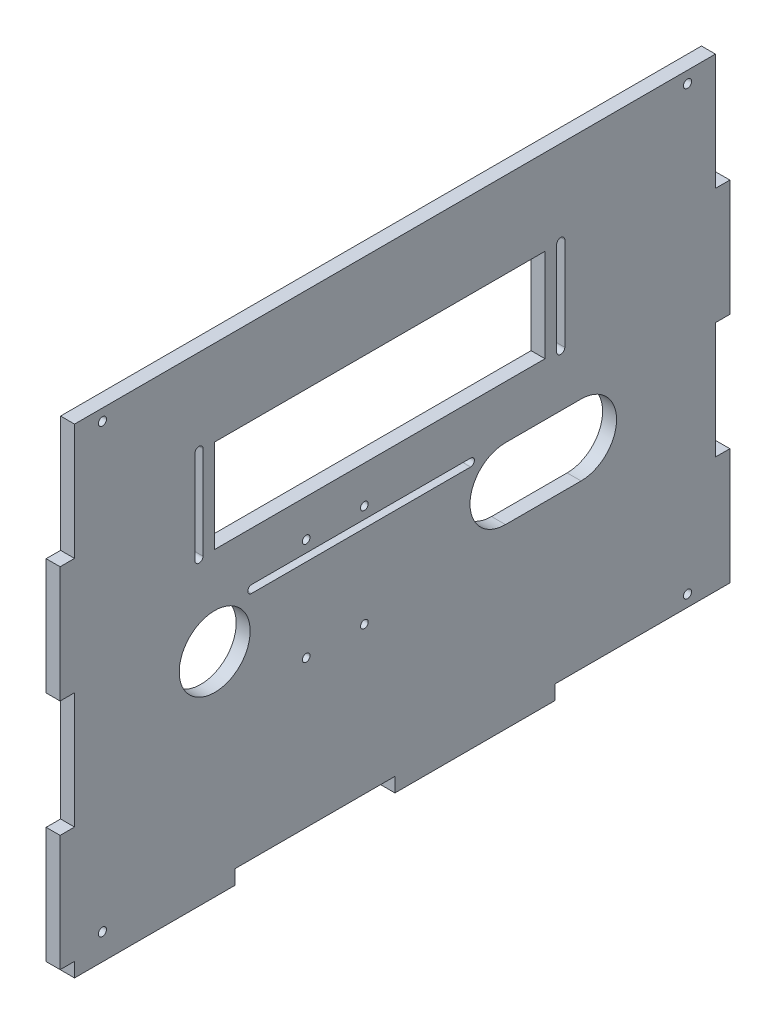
from build123d import *

# Parameters (mm, degrees)
CROQUIS1_W                 = 275.5
CROQUIS1_H                 = 200
CROQUIS1_R                 = 15.25
CROQUIS1_R_2               = 1.75
CROQUIS1_W_2               = 142
CROQUIS1_H_2               = 40
SALIENTE_EXTRUIR1_DEPTH    = 6
CROQUIS2_W                 = 6
CROQUIS2_H                 = 22
SALIENTE_EXTRUIR2_DEPTH    = 18
SALIENTE_EXTRUIR3_DEPTH    = 2
SALIENTE_EXTRUIR4_DEPTH    = 2
CROQUIS5_R                 = 4.15
CORTAR_EXTRUIR1_DEPTH      = 6
MATRIZL1_COUNT             = 2
MATRIZL1_PITCH             = 25
CROQUIS19_W                = 16.392304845
CROQUIS19_H                = 15.5
SALIENTE_EXTRUIR7_DEPTH    = 3
CORTAR_EXTRUIR2_DEPTH      = 191.332215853
CORTAR_EXTRUIR2_DEPTH_BACK = 191.332215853
CROQUIS20_R                = 1.65
CROQUIS22_W                = 268.062698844
CROQUIS22_H                = 197.570901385
SALIENTE_EXTRUIR9_DEPTH    = 6
CROQUIS23_W                = 27.889971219
CROQUIS23_H                = 62.645335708
CORTAR_EXTRUIR3_DEPTH      = 190.575558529


with BuildPart() as part:
    # Croquis1 → Saliente-Extruir1 (new body)
    with BuildSketch(Plane(origin=(0, 0, 0), x_dir=(0, 0, -1), z_dir=(1, 0, 0))):
        with Locations((13, 14.790199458)):
            Rectangle(CROQUIS1_W, CROQUIS1_H)
        with Locations((-64.5, 0)):
            Circle(CROQUIS1_R, mode=Mode.SUBTRACT)
        with Locations((138.75, 109.790199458)):
            Circle(CROQUIS1_R_2, mode=Mode.SUBTRACT)
        with Locations(Location((-112.75, 109.790199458, 0), (0, 0, 180))):
            Circle(CROQUIS1_R_2, mode=Mode.SUBTRACT)
        with Locations(Location((138.75, -80.209800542, 0), (0, 0, 180))):
            Circle(CROQUIS1_R_2, mode=Mode.SUBTRACT)
        with Locations((-112.75, -80.209800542)):
            Circle(CROQUIS1_R_2, mode=Mode.SUBTRACT)
        with BuildLine():
            Line((93, 15.25), (60.5, 15.25))
            ThreePointArc((60.5, 15.25), (45.25, 0), (60.5, -15.25))
            Line((60.5, -15.25), (93, -15.25))
            ThreePointArc((93, -15.25), (108.25, 0), (93, 15.25))
        make_face(mode=Mode.SUBTRACT)
        with Locations((6.5, 58)):
            Rectangle(CROQUIS1_W_2, CROQUIS1_H_2, mode=Mode.SUBTRACT)
        with BuildLine():
            Line((-73, 78), (-73, 38))
            ThreePointArc((-73, 38), (-71.25, 36.25), (-69.5, 38))
            Line((-69.5, 38), (-69.5, 78))
            ThreePointArc((-69.5, 78), (-71.25, 79.75), (-73, 78))
        make_face(mode=Mode.SUBTRACT)
        with BuildLine():
            Line((86, 78), (86, 38))
            ThreePointArc((86, 38), (84.25, 36.25), (82.5, 38))
            Line((82.5, 38), (82.5, 78))
            ThreePointArc((82.5, 78), (84.25, 79.75), (86, 78))
        make_face(mode=Mode.SUBTRACT)
        with BuildLine():
            Line((45.5, 17), (-48.61482931, 17))
            ThreePointArc((-48.61482931, 17), (-50.26482931, 15.35), (-48.61482931, 13.7))
            Line((-48.61482931, 13.7), (45.5, 13.7))
            ThreePointArc((45.5, 13.7), (47.15, 15.35), (45.5, 17))
        make_face(mode=Mode.SUBTRACT)
    extrude(amount=SALIENTE_EXTRUIR1_DEPTH)

    # Croquis2 → Saliente-Extruir2 (add)
    with BuildSketch(Plane(origin=(6, 0, 0), x_dir=(0, 0, -1), z_dir=(1, 0, 0))):
        with Locations((5, 0)):
            Rectangle(CROQUIS2_W, CROQUIS2_H)
    saliente_extruir2 = extrude(amount=SALIENTE_EXTRUIR2_DEPTH)

    # Croquis3 → Saliente-Extruir3 (add)
    with BuildSketch(Plane(origin=(0, 11, 0), x_dir=(1, 0, 0), z_dir=(0, 1, 0))):
        Polygon((6, -8.392304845), (24, 2), (6, 2), align=None)
    saliente_extruir3 = extrude(amount=-SALIENTE_EXTRUIR3_DEPTH)

    # Croquis4 → Saliente-Extruir4 (add)
    with BuildSketch(Plane(origin=(0, -11, 0), x_dir=(-1, 0, 0), z_dir=(0, -1, 0))):
        Polygon((-24, 2), (-6, -8.392304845), (-6, 2), align=None)
    saliente_extruir4 = extrude(amount=-SALIENTE_EXTRUIR4_DEPTH)

    # Croquis5 → Cortar-Extruir1 (cut)
    with BuildSketch(Plane(origin=(0, 0, -8), x_dir=(-1, 0, 0), z_dir=(0, 0, -1))):
        with Locations((-15, 0)):
            Circle(CROQUIS5_R)
    cortar_extruir1 = extrude(amount=-CORTAR_EXTRUIR1_DEPTH, mode=Mode.SUBTRACT)

    # MatrizL1: Saliente-Extruir2, Saliente-Extruir3, Saliente-Extruir4, Cortar-Extruir1 ×2
    with Locations(*[(0, 0, i * MATRIZL1_PITCH) for i in range(1, MATRIZL1_COUNT)]):
        add(saliente_extruir2)
        add(saliente_extruir3)
        add(saliente_extruir4)
        add(cortar_extruir1, mode=Mode.SUBTRACT)

    # Croquis19 → Saliente-Extruir7 (add)
    with BuildSketch(Plane(origin=(6, 0, 0), x_dir=(0, 0, -1), z_dir=(1, 0, 0))):
        with Locations((-0.196152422, -18.75)):
            Rectangle(CROQUIS19_W, CROQUIS19_H)
        with Locations((-25.196152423, -18.75)):
            Rectangle(CROQUIS19_W, CROQUIS19_H)
        with Locations((-25.196152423, 18.75)):
            Rectangle(CROQUIS19_W, CROQUIS19_H)
        with Locations((-0.196152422, 18.75)):
            Rectangle(CROQUIS19_W, CROQUIS19_H)
    extrude(amount=SALIENTE_EXTRUIR7_DEPTH)

    # Croquis20 → Cortar-Extruir2 (cut, two sides: drawn at the far end of the back side and taken through both)
    with BuildSketch(Plane(origin=(6, 0, 0), x_dir=(0, 0, -1), z_dir=(1, 0, 0)).offset(-CORTAR_EXTRUIR2_DEPTH_BACK)):
        with Locations((-0.160287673, -22)):
            Circle(CROQUIS20_R)
        with Locations((-25.160287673, -22)):
            Circle(CROQUIS20_R)
        with Locations((-25.160287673, 22)):
            Circle(CROQUIS20_R)
        with Locations((-0.160287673, 22)):
            Circle(CROQUIS20_R)
    extrude(amount=CORTAR_EXTRUIR2_DEPTH + CORTAR_EXTRUIR2_DEPTH_BACK, mode=Mode.SUBTRACT)

    # Croquis22 → Saliente-Extruir9 (add)
    with BuildSketch(Plane(origin=(0, 0, 0), x_dir=(0, 0, -1), z_dir=(1, 0, 0))):
        Polygon((-130.95, 14.790199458), (-130.95, 64.790199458), (-124.75, 64.790199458), (-124.75, 114.790199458), (-55.875, 114.790199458), (13, 114.790199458), (81.875, 114.790199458), (150.75, 114.790199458), (150.75, 64.790199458), (156.95, 64.790199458), (156.95, 14.790199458), (150.75, 14.790199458), (150.75, -35.209800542), (156.95, -35.209800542), (156.95, -85.209800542), (150.75, -85.209800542), (81.875, -85.209800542), (81.875, -91.409800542), (13, -91.409800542), (13, -85.209800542), (-55.875, -85.209800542), (-55.875, -91.409800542), (-124.75, -91.409800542), (-124.75, -85.209800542), (-130.95, -85.209800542), (-130.95, -35.209800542), (-124.75, -35.209800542), (-124.75, 14.790199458), align=None)
        with Locations((10.532356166, 14.603022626)):
            Rectangle(CROQUIS22_W, CROQUIS22_H, mode=Mode.SUBTRACT)
    extrude(amount=SALIENTE_EXTRUIR9_DEPTH)

    # Croquis23 → Cortar-Extruir3 (cut, through all)
    with BuildSketch(Plane(origin=(0, 0, -8), x_dir=(-1, 0, 0), z_dir=(0, 0, -1))):
        with Locations((-19.94498561, -0.286945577)):
            Rectangle(CROQUIS23_W, CROQUIS23_H)
    extrude(amount=-CORTAR_EXTRUIR3_DEPTH, mode=Mode.SUBTRACT)


solid = part.part
